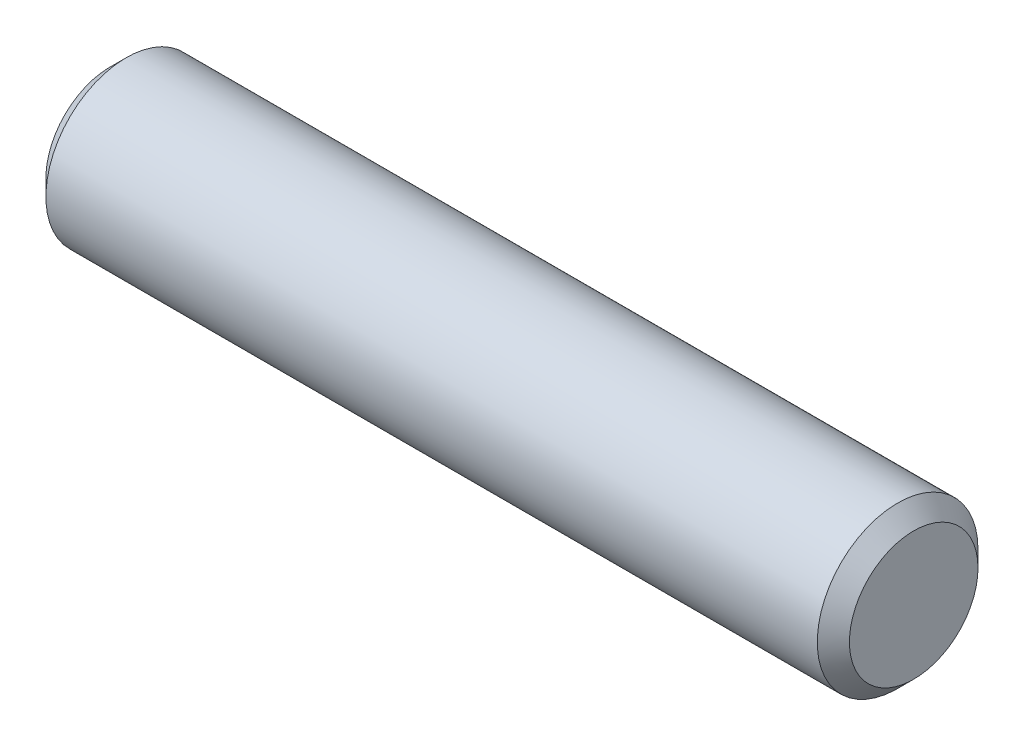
from build123d import *

# Parameters (mm, degrees)
ESQUISSE1_R          = 5
BASE_EXTRUSION_DEPTH = 50
CHANFREIN1_SIZE      = 1


with BuildPart() as part:
    # Esquisse1 → Base-Extrusion (new body)
    with BuildSketch(Plane(origin=(0, 0, 0), x_dir=(0, 0, -1), z_dir=(1, 0, 0))):
        Circle(ESQUISSE1_R)
    extrude(amount=-BASE_EXTRUSION_DEPTH)

    # Chanfrein1
    chanfrein1_edges = [part.edges().sort_by_distance(p)[0] for p in [
        (0, 0, 5),
        (-50, 0, 5),
    ]]
    chamfer(chanfrein1_edges, length=CHANFREIN1_SIZE)


solid = part.part
